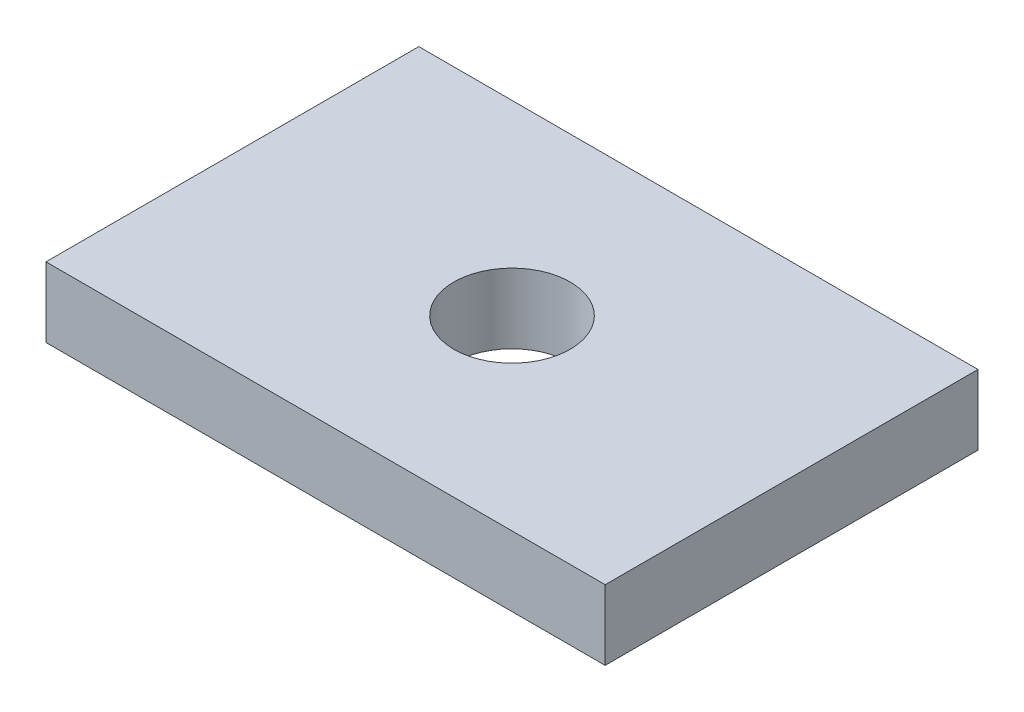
from build123d import *

# Parameters (mm, degrees)
SKETCH_1_W          = 120
SKETCH_1_H          = 80
EXTRUDE_1_DEPTH     = 15
SKETCH_2_R          = 12.5
CUT_EXTRUDE_1_DEPTH = 15


with BuildPart() as part:
    # Sketch 1 → Extrude 1 (new body)
    with BuildSketch(Plane(origin=(0, 0, 0), x_dir=(1, 0, 0), z_dir=(0, 1, 0))):
        with Locations((60, 40)):
            Rectangle(SKETCH_1_W, SKETCH_1_H)
    extrude(amount=-EXTRUDE_1_DEPTH)

    # Sketch 2 → Cut-Extrude 1 (cut)
    with BuildSketch(Plane(origin=(0, 0, 0), x_dir=(1, 0, 0), z_dir=(0, 1, 0))):
        with Locations(Location((60, 40, 0), (0, 0, 270))):
            Circle(SKETCH_2_R)
    extrude(amount=-CUT_EXTRUDE_1_DEPTH, mode=Mode.SUBTRACT)


solid = part.part
